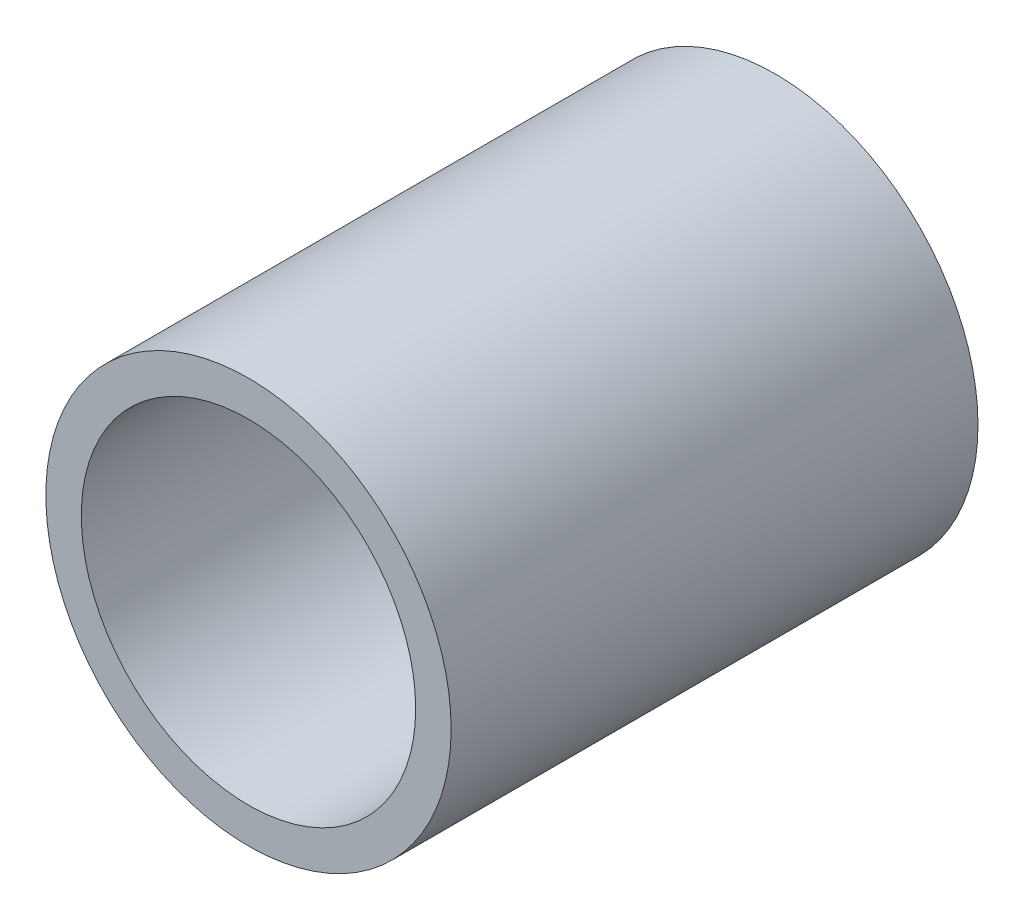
from build123d import *

# Parameters (mm, degrees)
ESQUISSE1_R      = 4
ESQUISSE1_R_2    = 3.3
EXTRUSION1_DEPTH = 10.4


with BuildPart() as part:
    # Esquisse1 → Extrusion1 (new body)
    with BuildSketch(Plane.XY):
        Circle(ESQUISSE1_R)
        Circle(ESQUISSE1_R_2, mode=Mode.SUBTRACT)
    extrude(amount=EXTRUSION1_DEPTH)


solid = part.part
